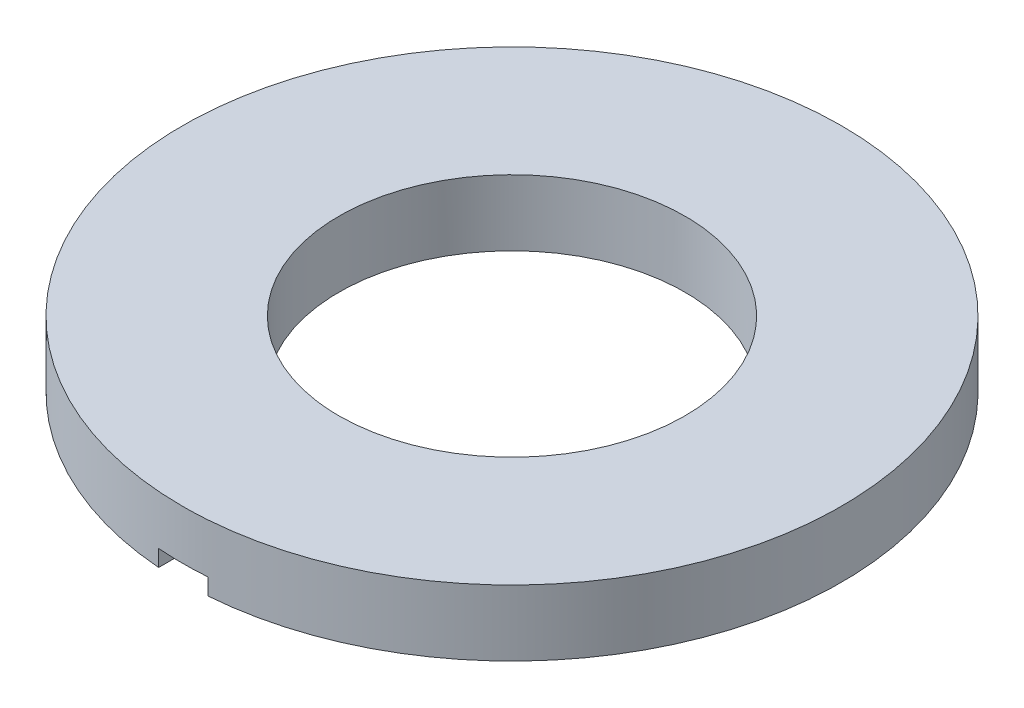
ISO-10303-21;
HEADER;
FILE_DESCRIPTION(('STEP AP214'),'2;1');
FILE_NAME('part.step','',(''),(''),'','','');
FILE_SCHEMA(('AUTOMOTIVE_DESIGN { 1 0 10303 214 1 1 1 1 }'));
ENDSEC;
DATA;
#1=APPLICATION_CONTEXT('core data for automotive mechanical design processes');
#2=APPLICATION_PROTOCOL_DEFINITION('international standard','automotive_design',2000,#1);
#3=PRODUCT_CONTEXT('',#1,'mechanical');
#4=PRODUCT('Part','Part','',(#3));
#5=PRODUCT_RELATED_PRODUCT_CATEGORY('part','',(#4));
#6=PRODUCT_DEFINITION_FORMATION('','',#4);
#7=PRODUCT_DEFINITION_CONTEXT('part definition',#1,'design');
#8=PRODUCT_DEFINITION('design','',#6,#7);
#9=PRODUCT_DEFINITION_SHAPE('','',#8);
#10=(LENGTH_UNIT() NAMED_UNIT(*) SI_UNIT(.MILLI.,.METRE.));
#11=(NAMED_UNIT(*) PLANE_ANGLE_UNIT() SI_UNIT($,.RADIAN.));
#12=(NAMED_UNIT(*) SI_UNIT($,.STERADIAN.) SOLID_ANGLE_UNIT());
#13=UNCERTAINTY_MEASURE_WITH_UNIT(LENGTH_MEASURE(1.E-05),#10,'distance_accuracy_value','');
#14=(GEOMETRIC_REPRESENTATION_CONTEXT(3) GLOBAL_UNCERTAINTY_ASSIGNED_CONTEXT((#13)) GLOBAL_UNIT_ASSIGNED_CONTEXT((#10,
#11,#12)) REPRESENTATION_CONTEXT('',''));
#15=CARTESIAN_POINT('',(0.,0.,0.));
#16=DIRECTION('',(0.,0.,1.));
#17=DIRECTION('',(1.,0.,0.));
#18=AXIS2_PLACEMENT_3D('',#15,#16,#17);
#19=CARTESIAN_POINT('',(0.,1.6,0.));
#20=DIRECTION('',(0.,1.,0.));
#21=DIRECTION('',(0.,0.,1.));
#22=AXIS2_PLACEMENT_3D('',#19,#20,#21);
#23=PLANE('',#22);
#24=CARTESIAN_POINT('',(0.,1.6,0.));
#25=DIRECTION('',(0.,1.,0.));
#26=DIRECTION('',(0.,0.,1.));
#27=AXIS2_PLACEMENT_3D('',#24,#25,#26);
#28=CIRCLE('',#27,8.);
#29=CARTESIAN_POINT('',(0.,1.6,8.));
#30=VERTEX_POINT('',#29);
#31=EDGE_CURVE('E114',#30,#30,#28,.T.);
#32=ORIENTED_EDGE('',*,*,#31,.T.);
#33=EDGE_LOOP('',(#32));
#34=FACE_BOUND('',#33,.T.);
#35=CARTESIAN_POINT('',(0.,1.6,0.));
#36=DIRECTION('',(0.,1.,0.));
#37=DIRECTION('',(0.,0.,1.));
#38=AXIS2_PLACEMENT_3D('',#35,#36,#37);
#39=CIRCLE('',#38,4.2);
#40=CARTESIAN_POINT('',(0.,1.6,4.2));
#41=VERTEX_POINT('',#40);
#42=EDGE_CURVE('E102',#41,#41,#39,.T.);
#43=ORIENTED_EDGE('',*,*,#42,.F.);
#44=EDGE_LOOP('',(#43));
#45=FACE_BOUND('',#44,.T.);
#46=ADVANCED_FACE('F39',(#34,#45),#23,.T.);
#47=CARTESIAN_POINT('',(0.,0.,0.));
#48=DIRECTION('',(0.,1.,0.));
#49=DIRECTION('',(0.,0.,1.));
#50=AXIS2_PLACEMENT_3D('',#47,#48,#49);
#51=PLANE('',#50);
#52=CARTESIAN_POINT('',(0.,0.,0.));
#53=DIRECTION('',(0.,1.,0.));
#54=DIRECTION('',(0.,0.,1.));
#55=AXIS2_PLACEMENT_3D('',#52,#53,#54);
#56=CIRCLE('',#55,8.);
#57=CARTESIAN_POINT('',(0.6,0.,7.97746827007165));
#58=VERTEX_POINT('',#57);
#59=CARTESIAN_POINT('',(-0.6,0.,7.97746827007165));
#60=VERTEX_POINT('',#59);
#61=EDGE_CURVE('E94',#58,#60,#56,.T.);
#62=ORIENTED_EDGE('',*,*,#61,.F.);
#63=DIRECTION('',(0.,0.,1.));
#64=VECTOR('',#63,1.);
#65=CARTESIAN_POINT('',(0.6,0.,0.4));
#66=LINE('',#65,#64);
#67=CARTESIAN_POINT('',(0.6,0.,4.15692193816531));
#68=VERTEX_POINT('',#67);
#69=EDGE_CURVE('E81',#68,#58,#66,.T.);
#70=ORIENTED_EDGE('',*,*,#69,.F.);
#71=CARTESIAN_POINT('',(0.,0.,0.));
#72=DIRECTION('',(0.,1.,0.));
#73=DIRECTION('',(0.,0.,1.));
#74=AXIS2_PLACEMENT_3D('',#71,#72,#73);
#75=CIRCLE('',#74,4.2);
#76=CARTESIAN_POINT('',(-0.6,0.,4.15692193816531));
#77=VERTEX_POINT('',#76);
#78=EDGE_CURVE('E92',#68,#77,#75,.T.);
#79=ORIENTED_EDGE('',*,*,#78,.T.);
#80=DIRECTION('',(0.,0.,-1.));
#81=VECTOR('',#80,1.);
#82=CARTESIAN_POINT('',(-0.6,0.,0.4));
#83=LINE('',#82,#81);
#84=EDGE_CURVE('E96',#60,#77,#83,.T.);
#85=ORIENTED_EDGE('',*,*,#84,.F.);
#86=EDGE_LOOP('',(#62,#70,#79,#85));
#87=FACE_BOUND('',#86,.T.);
#88=ADVANCED_FACE('F90',(#87),#51,.F.);
#89=CARTESIAN_POINT('',(0.,1.6,0.));
#90=DIRECTION('',(0.,-1.,0.));
#91=DIRECTION('',(0.,0.,-1.));
#92=AXIS2_PLACEMENT_3D('',#89,#90,#91);
#93=CYLINDRICAL_SURFACE('',#92,8.);
#94=ORIENTED_EDGE('',*,*,#31,.F.);
#95=EDGE_LOOP('',(#94));
#96=FACE_BOUND('',#95,.T.);
#97=CARTESIAN_POINT('',(0.,0.4,0.));
#98=DIRECTION('',(0.,1.,0.));
#99=DIRECTION('',(0.,0.,1.));
#100=AXIS2_PLACEMENT_3D('',#97,#98,#99);
#101=CIRCLE('',#100,8.);
#102=CARTESIAN_POINT('',(-0.6,0.4,7.97746827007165));
#103=VERTEX_POINT('',#102);
#104=CARTESIAN_POINT('',(0.6,0.4,7.97746827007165));
#105=VERTEX_POINT('',#104);
#106=EDGE_CURVE('E60',#103,#105,#101,.T.);
#107=ORIENTED_EDGE('',*,*,#106,.T.);
#108=DIRECTION('',(0.,-1.,0.));
#109=VECTOR('',#108,1.);
#110=CARTESIAN_POINT('',(0.6,1.6,7.97746827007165));
#111=LINE('',#110,#109);
#112=EDGE_CURVE('E103',#105,#58,#111,.T.);
#113=ORIENTED_EDGE('',*,*,#112,.T.);
#114=ORIENTED_EDGE('',*,*,#61,.T.);
#115=DIRECTION('',(0.,-1.,0.));
#116=VECTOR('',#115,1.);
#117=CARTESIAN_POINT('',(-0.6,1.6,7.97746827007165));
#118=LINE('',#117,#116);
#119=EDGE_CURVE('E111',#60,#103,#118,.F.);
#120=ORIENTED_EDGE('',*,*,#119,.T.);
#121=EDGE_LOOP('',(#107,#113,#114,#120));
#122=FACE_BOUND('',#121,.T.);
#123=ADVANCED_FACE('F41',(#96,#122),#93,.T.);
#124=CARTESIAN_POINT('',(0.,1.6,0.));
#125=DIRECTION('',(0.,-1.,0.));
#126=DIRECTION('',(0.,0.,-1.));
#127=AXIS2_PLACEMENT_3D('',#124,#125,#126);
#128=CYLINDRICAL_SURFACE('',#127,4.2);
#129=DIRECTION('',(0.,-1.,0.));
#130=VECTOR('',#129,1.);
#131=CARTESIAN_POINT('',(0.6,1.6,4.15692193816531));
#132=LINE('',#131,#130);
#133=CARTESIAN_POINT('',(0.6,0.4,4.15692193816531));
#134=VERTEX_POINT('',#133);
#135=EDGE_CURVE('E11',#134,#68,#132,.T.);
#136=ORIENTED_EDGE('',*,*,#135,.F.);
#137=CARTESIAN_POINT('',(0.,0.4,0.));
#138=DIRECTION('',(0.,1.,0.));
#139=DIRECTION('',(0.,0.,1.));
#140=AXIS2_PLACEMENT_3D('',#137,#138,#139);
#141=CIRCLE('',#140,4.2);
#142=CARTESIAN_POINT('',(-0.6,0.4,4.15692193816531));
#143=VERTEX_POINT('',#142);
#144=EDGE_CURVE('E118',#143,#134,#141,.T.);
#145=ORIENTED_EDGE('',*,*,#144,.F.);
#146=DIRECTION('',(0.,-1.,0.));
#147=VECTOR('',#146,1.);
#148=CARTESIAN_POINT('',(-0.6,1.6,4.15692193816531));
#149=LINE('',#148,#147);
#150=EDGE_CURVE('E48',#77,#143,#149,.F.);
#151=ORIENTED_EDGE('',*,*,#150,.F.);
#152=ORIENTED_EDGE('',*,*,#78,.F.);
#153=EDGE_LOOP('',(#136,#145,#151,#152));
#154=FACE_BOUND('',#153,.T.);
#155=ORIENTED_EDGE('',*,*,#42,.T.);
#156=EDGE_LOOP('',(#155));
#157=FACE_BOUND('',#156,.T.);
#158=ADVANCED_FACE('F99',(#154,#157),#128,.F.);
#159=CARTESIAN_POINT('',(0.6,0.4,0.4));
#160=DIRECTION('',(1.,0.,0.));
#161=DIRECTION('',(0.,0.,-1.));
#162=AXIS2_PLACEMENT_3D('',#159,#160,#161);
#163=PLANE('',#162);
#164=DIRECTION('',(0.,0.,1.));
#165=VECTOR('',#164,1.);
#166=CARTESIAN_POINT('',(0.6,0.4,0.4));
#167=LINE('',#166,#165);
#168=EDGE_CURVE('E83',#134,#105,#167,.T.);
#169=ORIENTED_EDGE('',*,*,#168,.F.);
#170=ORIENTED_EDGE('',*,*,#135,.T.);
#171=ORIENTED_EDGE('',*,*,#69,.T.);
#172=ORIENTED_EDGE('',*,*,#112,.F.);
#173=EDGE_LOOP('',(#169,#170,#171,#172));
#174=FACE_BOUND('',#173,.T.);
#175=ADVANCED_FACE('F79',(#174),#163,.F.);
#176=CARTESIAN_POINT('',(-0.6,0.4,0.4));
#177=DIRECTION('',(-1.,0.,0.));
#178=DIRECTION('',(0.,0.,1.));
#179=AXIS2_PLACEMENT_3D('',#176,#177,#178);
#180=PLANE('',#179);
#181=ORIENTED_EDGE('',*,*,#84,.T.);
#182=ORIENTED_EDGE('',*,*,#150,.T.);
#183=DIRECTION('',(0.,0.,-1.));
#184=VECTOR('',#183,1.);
#185=CARTESIAN_POINT('',(-0.6,0.4,0.4));
#186=LINE('',#185,#184);
#187=EDGE_CURVE('E55',#103,#143,#186,.T.);
#188=ORIENTED_EDGE('',*,*,#187,.F.);
#189=ORIENTED_EDGE('',*,*,#119,.F.);
#190=EDGE_LOOP('',(#181,#182,#188,#189));
#191=FACE_BOUND('',#190,.T.);
#192=ADVANCED_FACE('F125',(#191),#180,.F.);
#193=CARTESIAN_POINT('',(0.,0.4,0.));
#194=DIRECTION('',(0.,1.,0.));
#195=DIRECTION('',(0.,0.,1.));
#196=AXIS2_PLACEMENT_3D('',#193,#194,#195);
#197=PLANE('',#196);
#198=ORIENTED_EDGE('',*,*,#106,.F.);
#199=ORIENTED_EDGE('',*,*,#187,.T.);
#200=ORIENTED_EDGE('',*,*,#144,.T.);
#201=ORIENTED_EDGE('',*,*,#168,.T.);
#202=EDGE_LOOP('',(#198,#199,#200,#201));
#203=FACE_BOUND('',#202,.T.);
#204=ADVANCED_FACE('F127',(#203),#197,.F.);
#205=CLOSED_SHELL('',(#46,#88,#123,#158,#175,#192,#204));
#206=MANIFOLD_SOLID_BREP('B2',#205);
#207=ADVANCED_BREP_SHAPE_REPRESENTATION('',(#18,#206),#14);
#208=SHAPE_DEFINITION_REPRESENTATION(#9,#207);
ENDSEC;
END-ISO-10303-21;
